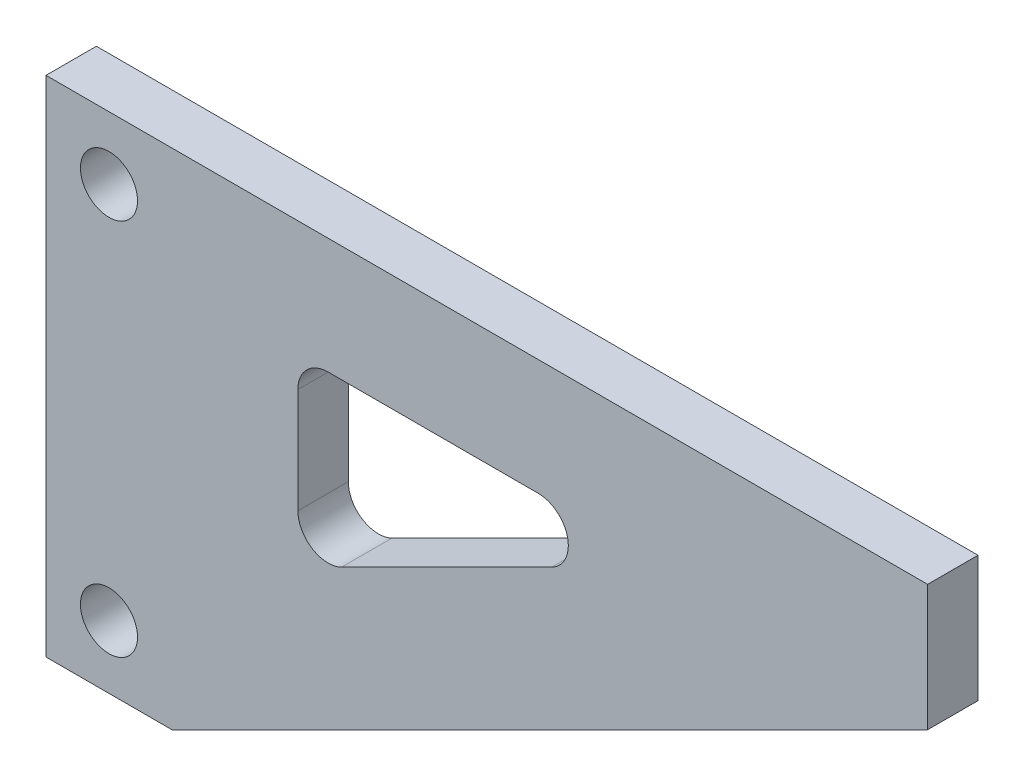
ISO-10303-21;
HEADER;
FILE_DESCRIPTION(('STEP AP214'),'2;1');
FILE_NAME('part.step','',(''),(''),'','','');
FILE_SCHEMA(('AUTOMOTIVE_DESIGN { 1 0 10303 214 1 1 1 1 }'));
ENDSEC;
DATA;
#1=APPLICATION_CONTEXT('core data for automotive mechanical design processes');
#2=APPLICATION_PROTOCOL_DEFINITION('international standard','automotive_design',2000,#1);
#3=PRODUCT_CONTEXT('',#1,'mechanical');
#4=PRODUCT('Part','Part','',(#3));
#5=PRODUCT_RELATED_PRODUCT_CATEGORY('part','',(#4));
#6=PRODUCT_DEFINITION_FORMATION('','',#4);
#7=PRODUCT_DEFINITION_CONTEXT('part definition',#1,'design');
#8=PRODUCT_DEFINITION('design','',#6,#7);
#9=PRODUCT_DEFINITION_SHAPE('','',#8);
#10=(LENGTH_UNIT() NAMED_UNIT(*) SI_UNIT(.MILLI.,.METRE.));
#11=(NAMED_UNIT(*) PLANE_ANGLE_UNIT() SI_UNIT($,.RADIAN.));
#12=(NAMED_UNIT(*) SI_UNIT($,.STERADIAN.) SOLID_ANGLE_UNIT());
#13=UNCERTAINTY_MEASURE_WITH_UNIT(LENGTH_MEASURE(1.E-05),#10,'distance_accuracy_value','');
#14=(GEOMETRIC_REPRESENTATION_CONTEXT(3) GLOBAL_UNCERTAINTY_ASSIGNED_CONTEXT((#13)) GLOBAL_UNIT_ASSIGNED_CONTEXT((#10,
#11,#12)) REPRESENTATION_CONTEXT('',''));
#15=CARTESIAN_POINT('',(0.,0.,0.));
#16=DIRECTION('',(0.,0.,1.));
#17=DIRECTION('',(1.,0.,0.));
#18=AXIS2_PLACEMENT_3D('',#15,#16,#17);
#19=CARTESIAN_POINT('',(0.,0.,5.));
#20=DIRECTION('',(1.,0.,0.));
#21=DIRECTION('',(0.,0.,-1.));
#22=AXIS2_PLACEMENT_3D('',#19,#20,#21);
#23=PLANE('',#22);
#24=DIRECTION('',(0.,-1.,0.));
#25=VECTOR('',#24,1.);
#26=CARTESIAN_POINT('',(0.,0.,-5.));
#27=LINE('',#26,#25);
#28=CARTESIAN_POINT('',(0.,100.,-5.));
#29=VERTEX_POINT('',#28);
#30=CARTESIAN_POINT('',(0.,0.,-5.));
#31=VERTEX_POINT('',#30);
#32=EDGE_CURVE('E193',#29,#31,#27,.T.);
#33=ORIENTED_EDGE('',*,*,#32,.T.);
#34=DIRECTION('',(0.,0.,-1.));
#35=VECTOR('',#34,1.);
#36=CARTESIAN_POINT('',(0.,0.,5.));
#37=LINE('',#36,#35);
#38=CARTESIAN_POINT('',(0.,0.,5.));
#39=VERTEX_POINT('',#38);
#40=EDGE_CURVE('E11',#39,#31,#37,.T.);
#41=ORIENTED_EDGE('',*,*,#40,.F.);
#42=DIRECTION('',(0.,-1.,0.));
#43=VECTOR('',#42,1.);
#44=CARTESIAN_POINT('',(0.,0.,5.));
#45=LINE('',#44,#43);
#46=CARTESIAN_POINT('',(0.,100.,5.));
#47=VERTEX_POINT('',#46);
#48=EDGE_CURVE('E205',#47,#39,#45,.T.);
#49=ORIENTED_EDGE('',*,*,#48,.F.);
#50=DIRECTION('',(0.,0.,-1.));
#51=VECTOR('',#50,1.);
#52=CARTESIAN_POINT('',(0.,100.,5.));
#53=LINE('',#52,#51);
#54=EDGE_CURVE('E222',#47,#29,#53,.T.);
#55=ORIENTED_EDGE('',*,*,#54,.T.);
#56=EDGE_LOOP('',(#33,#41,#49,#55));
#57=FACE_BOUND('',#56,.T.);
#58=ADVANCED_FACE('F47',(#57),#23,.F.);
#59=CARTESIAN_POINT('',(25.,0.,5.));
#60=DIRECTION('',(0.,1.,0.));
#61=DIRECTION('',(-1.,0.,0.));
#62=AXIS2_PLACEMENT_3D('',#59,#60,#61);
#63=PLANE('',#62);
#64=DIRECTION('',(1.,0.,0.));
#65=VECTOR('',#64,1.);
#66=CARTESIAN_POINT('',(25.,0.,-5.));
#67=LINE('',#66,#65);
#68=CARTESIAN_POINT('',(25.,0.,-5.));
#69=VERTEX_POINT('',#68);
#70=EDGE_CURVE('E226',#31,#69,#67,.T.);
#71=ORIENTED_EDGE('',*,*,#70,.T.);
#72=DIRECTION('',(0.,0.,-1.));
#73=VECTOR('',#72,1.);
#74=CARTESIAN_POINT('',(25.,0.,5.));
#75=LINE('',#74,#73);
#76=CARTESIAN_POINT('',(25.,0.,5.));
#77=VERTEX_POINT('',#76);
#78=EDGE_CURVE('E55',#77,#69,#75,.T.);
#79=ORIENTED_EDGE('',*,*,#78,.F.);
#80=DIRECTION('',(1.,0.,0.));
#81=VECTOR('',#80,1.);
#82=CARTESIAN_POINT('',(25.,0.,5.));
#83=LINE('',#82,#81);
#84=EDGE_CURVE('E209',#39,#77,#83,.T.);
#85=ORIENTED_EDGE('',*,*,#84,.F.);
#86=ORIENTED_EDGE('',*,*,#40,.T.);
#87=EDGE_LOOP('',(#71,#79,#85,#86));
#88=FACE_BOUND('',#87,.T.);
#89=ADVANCED_FACE('F271',(#88),#63,.F.);
#90=CARTESIAN_POINT('',(175.,75.,5.));
#91=DIRECTION('',(-0.447213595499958,0.894427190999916,0.));
#92=DIRECTION('',(-0.894427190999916,-0.447213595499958,0.));
#93=AXIS2_PLACEMENT_3D('',#90,#91,#92);
#94=PLANE('',#93);
#95=DIRECTION('',(0.894427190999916,0.447213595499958,0.));
#96=VECTOR('',#95,1.);
#97=CARTESIAN_POINT('',(175.,75.,-5.));
#98=LINE('',#97,#96);
#99=CARTESIAN_POINT('',(175.,75.,-5.));
#100=VERTEX_POINT('',#99);
#101=EDGE_CURVE('E229',#69,#100,#98,.T.);
#102=ORIENTED_EDGE('',*,*,#101,.T.);
#103=DIRECTION('',(0.,0.,-1.));
#104=VECTOR('',#103,1.);
#105=CARTESIAN_POINT('',(175.,75.,5.));
#106=LINE('',#105,#104);
#107=CARTESIAN_POINT('',(175.,75.,5.));
#108=VERTEX_POINT('',#107);
#109=EDGE_CURVE('E244',#108,#100,#106,.T.);
#110=ORIENTED_EDGE('',*,*,#109,.F.);
#111=DIRECTION('',(0.894427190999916,0.447213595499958,0.));
#112=VECTOR('',#111,1.);
#113=CARTESIAN_POINT('',(175.,75.,5.));
#114=LINE('',#113,#112);
#115=EDGE_CURVE('E213',#77,#108,#114,.T.);
#116=ORIENTED_EDGE('',*,*,#115,.F.);
#117=ORIENTED_EDGE('',*,*,#78,.T.);
#118=EDGE_LOOP('',(#102,#110,#116,#117));
#119=FACE_BOUND('',#118,.T.);
#120=ADVANCED_FACE('F253',(#119),#94,.F.);
#121=CARTESIAN_POINT('',(175.,100.,5.));
#122=DIRECTION('',(-1.,0.,0.));
#123=DIRECTION('',(0.,0.,1.));
#124=AXIS2_PLACEMENT_3D('',#121,#122,#123);
#125=PLANE('',#124);
#126=DIRECTION('',(0.,1.,0.));
#127=VECTOR('',#126,1.);
#128=CARTESIAN_POINT('',(175.,100.,-5.));
#129=LINE('',#128,#127);
#130=CARTESIAN_POINT('',(175.,100.,-5.));
#131=VERTEX_POINT('',#130);
#132=EDGE_CURVE('E232',#100,#131,#129,.T.);
#133=ORIENTED_EDGE('',*,*,#132,.T.);
#134=DIRECTION('',(0.,0.,-1.));
#135=VECTOR('',#134,1.);
#136=CARTESIAN_POINT('',(175.,100.,5.));
#137=LINE('',#136,#135);
#138=CARTESIAN_POINT('',(175.,100.,5.));
#139=VERTEX_POINT('',#138);
#140=EDGE_CURVE('E240',#139,#131,#137,.T.);
#141=ORIENTED_EDGE('',*,*,#140,.F.);
#142=DIRECTION('',(0.,1.,0.));
#143=VECTOR('',#142,1.);
#144=CARTESIAN_POINT('',(175.,100.,5.));
#145=LINE('',#144,#143);
#146=EDGE_CURVE('E216',#108,#139,#145,.T.);
#147=ORIENTED_EDGE('',*,*,#146,.F.);
#148=ORIENTED_EDGE('',*,*,#109,.T.);
#149=EDGE_LOOP('',(#133,#141,#147,#148));
#150=FACE_BOUND('',#149,.T.);
#151=ADVANCED_FACE('F261',(#150),#125,.F.);
#152=CARTESIAN_POINT('',(0.,100.,5.));
#153=DIRECTION('',(0.,-1.,0.));
#154=DIRECTION('',(0.,0.,-1.));
#155=AXIS2_PLACEMENT_3D('',#152,#153,#154);
#156=PLANE('',#155);
#157=DIRECTION('',(-1.,0.,0.));
#158=VECTOR('',#157,1.);
#159=CARTESIAN_POINT('',(0.,100.,-5.));
#160=LINE('',#159,#158);
#161=EDGE_CURVE('E210',#131,#29,#160,.T.);
#162=ORIENTED_EDGE('',*,*,#161,.T.);
#163=ORIENTED_EDGE('',*,*,#54,.F.);
#164=DIRECTION('',(-1.,0.,0.));
#165=VECTOR('',#164,1.);
#166=CARTESIAN_POINT('',(0.,100.,5.));
#167=LINE('',#166,#165);
#168=EDGE_CURVE('E219',#139,#47,#167,.T.);
#169=ORIENTED_EDGE('',*,*,#168,.F.);
#170=ORIENTED_EDGE('',*,*,#140,.T.);
#171=EDGE_LOOP('',(#162,#163,#169,#170));
#172=FACE_BOUND('',#171,.T.);
#173=ADVANCED_FACE('F265',(#172),#156,.F.);
#174=CARTESIAN_POINT('',(0.,100.,5.));
#175=DIRECTION('',(0.,0.,-1.));
#176=DIRECTION('',(-1.,0.,0.));
#177=AXIS2_PLACEMENT_3D('',#174,#175,#176);
#178=PLANE('',#177);
#179=CARTESIAN_POINT('',(12.5,87.5,5.));
#180=DIRECTION('',(0.,0.,1.));
#181=DIRECTION('',(1.,0.,0.));
#182=AXIS2_PLACEMENT_3D('',#179,#180,#181);
#183=CIRCLE('',#182,5.66755120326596);
#184=CARTESIAN_POINT('',(18.167551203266,87.5,5.));
#185=VERTEX_POINT('',#184);
#186=EDGE_CURVE('E325',#185,#185,#183,.T.);
#187=ORIENTED_EDGE('',*,*,#186,.F.);
#188=EDGE_LOOP('',(#187));
#189=FACE_BOUND('',#188,.T.);
#190=CARTESIAN_POINT('',(12.5,12.5,5.));
#191=DIRECTION('',(0.,0.,1.));
#192=DIRECTION('',(1.,0.,0.));
#193=AXIS2_PLACEMENT_3D('',#190,#191,#192);
#194=CIRCLE('',#193,5.66755120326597);
#195=CARTESIAN_POINT('',(18.167551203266,12.5,5.));
#196=VERTEX_POINT('',#195);
#197=EDGE_CURVE('E327',#196,#196,#194,.T.);
#198=ORIENTED_EDGE('',*,*,#197,.F.);
#199=EDGE_LOOP('',(#198));
#200=FACE_BOUND('',#199,.T.);
#201=DIRECTION('',(-1.,0.,0.));
#202=VECTOR('',#201,1.);
#203=CARTESIAN_POINT('',(56.,77.,5.));
#204=LINE('',#203,#202);
#205=CARTESIAN_POINT('',(97.6818926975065,77.,5.));
#206=VERTEX_POINT('',#205);
#207=CARTESIAN_POINT('',(56.,77.,5.));
#208=VERTEX_POINT('',#207);
#209=EDGE_CURVE('E175',#206,#208,#204,.T.);
#210=ORIENTED_EDGE('',*,*,#209,.F.);
#211=CARTESIAN_POINT('',(97.6818926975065,71.,5.));
#212=DIRECTION('',(0.,0.,1.));
#213=DIRECTION('',(-1.,0.,0.));
#214=AXIS2_PLACEMENT_3D('',#211,#212,#213);
#215=CIRCLE('',#214,6.);
#216=CARTESIAN_POINT('',(100.365174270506,65.6334368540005,5.));
#217=VERTEX_POINT('',#216);
#218=EDGE_CURVE('E62',#217,#206,#215,.T.);
#219=ORIENTED_EDGE('',*,*,#218,.F.);
#220=DIRECTION('',(0.894427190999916,0.447213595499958,0.));
#221=VECTOR('',#220,1.);
#222=CARTESIAN_POINT('',(58.6832815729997,44.7924905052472,5.));
#223=LINE('',#222,#221);
#224=CARTESIAN_POINT('',(58.6832815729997,44.7924905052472,5.));
#225=VERTEX_POINT('',#224);
#226=EDGE_CURVE('E152',#225,#217,#223,.T.);
#227=ORIENTED_EDGE('',*,*,#226,.F.);
#228=CARTESIAN_POINT('',(56.,50.1590536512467,5.));
#229=DIRECTION('',(0.,0.,1.));
#230=DIRECTION('',(1.,0.,0.));
#231=AXIS2_PLACEMENT_3D('',#228,#229,#230);
#232=CIRCLE('',#231,6.);
#233=CARTESIAN_POINT('',(50.,50.1590536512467,5.));
#234=VERTEX_POINT('',#233);
#235=EDGE_CURVE('E156',#234,#225,#232,.T.);
#236=ORIENTED_EDGE('',*,*,#235,.F.);
#237=DIRECTION('',(0.,-1.,0.));
#238=VECTOR('',#237,1.);
#239=CARTESIAN_POINT('',(50.,71.,5.));
#240=LINE('',#239,#238);
#241=CARTESIAN_POINT('',(50.,71.,5.));
#242=VERTEX_POINT('',#241);
#243=EDGE_CURVE('E183',#242,#234,#240,.T.);
#244=ORIENTED_EDGE('',*,*,#243,.F.);
#245=CARTESIAN_POINT('',(56.,71.,5.));
#246=DIRECTION('',(0.,0.,1.));
#247=DIRECTION('',(1.,0.,0.));
#248=AXIS2_PLACEMENT_3D('',#245,#246,#247);
#249=CIRCLE('',#248,6.);
#250=EDGE_CURVE('E179',#208,#242,#249,.T.);
#251=ORIENTED_EDGE('',*,*,#250,.F.);
#252=EDGE_LOOP('',(#210,#219,#227,#236,#244,#251));
#253=FACE_BOUND('',#252,.T.);
#254=ORIENTED_EDGE('',*,*,#48,.T.);
#255=ORIENTED_EDGE('',*,*,#84,.T.);
#256=ORIENTED_EDGE('',*,*,#115,.T.);
#257=ORIENTED_EDGE('',*,*,#146,.T.);
#258=ORIENTED_EDGE('',*,*,#168,.T.);
#259=EDGE_LOOP('',(#254,#255,#256,#257,#258));
#260=FACE_BOUND('',#259,.T.);
#261=ADVANCED_FACE('F269',(#189,#200,#253,#260),#178,.F.);
#262=CARTESIAN_POINT('',(0.,100.,-5.));
#263=DIRECTION('',(0.,0.,-1.));
#264=DIRECTION('',(-1.,0.,0.));
#265=AXIS2_PLACEMENT_3D('',#262,#263,#264);
#266=PLANE('',#265);
#267=CARTESIAN_POINT('',(12.5,87.5,-5.));
#268=DIRECTION('',(0.,0.,1.));
#269=DIRECTION('',(1.,0.,0.));
#270=AXIS2_PLACEMENT_3D('',#267,#268,#269);
#271=CIRCLE('',#270,5.66755120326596);
#272=CARTESIAN_POINT('',(18.167551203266,87.5,-5.));
#273=VERTEX_POINT('',#272);
#274=EDGE_CURVE('E176',#273,#273,#271,.T.);
#275=ORIENTED_EDGE('',*,*,#274,.T.);
#276=EDGE_LOOP('',(#275));
#277=FACE_BOUND('',#276,.T.);
#278=CARTESIAN_POINT('',(12.5,12.5,-5.));
#279=DIRECTION('',(0.,0.,1.));
#280=DIRECTION('',(1.,0.,0.));
#281=AXIS2_PLACEMENT_3D('',#278,#279,#280);
#282=CIRCLE('',#281,5.66755120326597);
#283=CARTESIAN_POINT('',(18.167551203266,12.5,-5.));
#284=VERTEX_POINT('',#283);
#285=EDGE_CURVE('E159',#284,#284,#282,.T.);
#286=ORIENTED_EDGE('',*,*,#285,.T.);
#287=EDGE_LOOP('',(#286));
#288=FACE_BOUND('',#287,.T.);
#289=CARTESIAN_POINT('',(97.6818926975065,71.,-5.));
#290=DIRECTION('',(0.,0.,1.));
#291=DIRECTION('',(-1.,0.,0.));
#292=AXIS2_PLACEMENT_3D('',#289,#290,#291);
#293=CIRCLE('',#292,6.);
#294=CARTESIAN_POINT('',(100.365174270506,65.6334368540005,-5.));
#295=VERTEX_POINT('',#294);
#296=CARTESIAN_POINT('',(97.6818926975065,77.,-5.));
#297=VERTEX_POINT('',#296);
#298=EDGE_CURVE('E132',#295,#297,#293,.T.);
#299=ORIENTED_EDGE('',*,*,#298,.T.);
#300=DIRECTION('',(-1.,0.,0.));
#301=VECTOR('',#300,1.);
#302=CARTESIAN_POINT('',(56.,77.,-5.));
#303=LINE('',#302,#301);
#304=CARTESIAN_POINT('',(56.,77.,-5.));
#305=VERTEX_POINT('',#304);
#306=EDGE_CURVE('E142',#297,#305,#303,.T.);
#307=ORIENTED_EDGE('',*,*,#306,.T.);
#308=CARTESIAN_POINT('',(56.,71.,-5.));
#309=DIRECTION('',(0.,0.,1.));
#310=DIRECTION('',(1.,0.,0.));
#311=AXIS2_PLACEMENT_3D('',#308,#309,#310);
#312=CIRCLE('',#311,6.);
#313=CARTESIAN_POINT('',(50.,71.,-5.));
#314=VERTEX_POINT('',#313);
#315=EDGE_CURVE('E70',#305,#314,#312,.T.);
#316=ORIENTED_EDGE('',*,*,#315,.T.);
#317=DIRECTION('',(0.,-1.,0.));
#318=VECTOR('',#317,1.);
#319=CARTESIAN_POINT('',(50.,71.,-5.));
#320=LINE('',#319,#318);
#321=CARTESIAN_POINT('',(50.,50.1590536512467,-5.));
#322=VERTEX_POINT('',#321);
#323=EDGE_CURVE('E164',#314,#322,#320,.T.);
#324=ORIENTED_EDGE('',*,*,#323,.T.);
#325=CARTESIAN_POINT('',(56.,50.1590536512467,-5.));
#326=DIRECTION('',(0.,0.,1.));
#327=DIRECTION('',(1.,0.,0.));
#328=AXIS2_PLACEMENT_3D('',#325,#326,#327);
#329=CIRCLE('',#328,6.);
#330=CARTESIAN_POINT('',(58.6832815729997,44.7924905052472,-5.));
#331=VERTEX_POINT('',#330);
#332=EDGE_CURVE('E168',#322,#331,#329,.T.);
#333=ORIENTED_EDGE('',*,*,#332,.T.);
#334=DIRECTION('',(0.894427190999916,0.447213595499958,0.));
#335=VECTOR('',#334,1.);
#336=CARTESIAN_POINT('',(58.6832815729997,44.7924905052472,-5.));
#337=LINE('',#336,#335);
#338=EDGE_CURVE('E139',#331,#295,#337,.T.);
#339=ORIENTED_EDGE('',*,*,#338,.T.);
#340=EDGE_LOOP('',(#299,#307,#316,#324,#333,#339));
#341=FACE_BOUND('',#340,.T.);
#342=ORIENTED_EDGE('',*,*,#32,.F.);
#343=ORIENTED_EDGE('',*,*,#161,.F.);
#344=ORIENTED_EDGE('',*,*,#132,.F.);
#345=ORIENTED_EDGE('',*,*,#101,.F.);
#346=ORIENTED_EDGE('',*,*,#70,.F.);
#347=EDGE_LOOP('',(#342,#343,#344,#345,#346));
#348=FACE_BOUND('',#347,.T.);
#349=ADVANCED_FACE('F147',(#277,#288,#341,#348),#266,.T.);
#350=CARTESIAN_POINT('',(97.6818926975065,71.,-5.));
#351=DIRECTION('',(0.,0.,1.));
#352=DIRECTION('',(1.,0.,0.));
#353=AXIS2_PLACEMENT_3D('',#350,#351,#352);
#354=CYLINDRICAL_SURFACE('',#353,6.);
#355=ORIENTED_EDGE('',*,*,#218,.T.);
#356=DIRECTION('',(0.,0.,1.));
#357=VECTOR('',#356,1.);
#358=CARTESIAN_POINT('',(97.6818926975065,77.,-5.));
#359=LINE('',#358,#357);
#360=EDGE_CURVE('E128',#297,#206,#359,.T.);
#361=ORIENTED_EDGE('',*,*,#360,.F.);
#362=ORIENTED_EDGE('',*,*,#298,.F.);
#363=DIRECTION('',(0.,0.,1.));
#364=VECTOR('',#363,1.);
#365=CARTESIAN_POINT('',(100.365174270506,65.6334368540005,-5.));
#366=LINE('',#365,#364);
#367=EDGE_CURVE('E190',#295,#217,#366,.T.);
#368=ORIENTED_EDGE('',*,*,#367,.T.);
#369=EDGE_LOOP('',(#355,#361,#362,#368));
#370=FACE_BOUND('',#369,.T.);
#371=ADVANCED_FACE('F130',(#370),#354,.F.);
#372=CARTESIAN_POINT('',(58.6832815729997,44.7924905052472,-5.));
#373=DIRECTION('',(0.447213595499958,-0.894427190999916,0.));
#374=DIRECTION('',(0.894427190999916,0.447213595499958,0.));
#375=AXIS2_PLACEMENT_3D('',#372,#373,#374);
#376=PLANE('',#375);
#377=ORIENTED_EDGE('',*,*,#226,.T.);
#378=ORIENTED_EDGE('',*,*,#367,.F.);
#379=ORIENTED_EDGE('',*,*,#338,.F.);
#380=DIRECTION('',(0.,0.,1.));
#381=VECTOR('',#380,1.);
#382=CARTESIAN_POINT('',(58.6832815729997,44.7924905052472,-5.));
#383=LINE('',#382,#381);
#384=EDGE_CURVE('E194',#331,#225,#383,.T.);
#385=ORIENTED_EDGE('',*,*,#384,.T.);
#386=EDGE_LOOP('',(#377,#378,#379,#385));
#387=FACE_BOUND('',#386,.T.);
#388=ADVANCED_FACE('F294',(#387),#376,.F.);
#389=CARTESIAN_POINT('',(56.,50.1590536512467,-5.));
#390=DIRECTION('',(0.,0.,1.));
#391=DIRECTION('',(1.,0.,0.));
#392=AXIS2_PLACEMENT_3D('',#389,#390,#391);
#393=CYLINDRICAL_SURFACE('',#392,6.);
#394=ORIENTED_EDGE('',*,*,#235,.T.);
#395=ORIENTED_EDGE('',*,*,#384,.F.);
#396=ORIENTED_EDGE('',*,*,#332,.F.);
#397=DIRECTION('',(0.,0.,1.));
#398=VECTOR('',#397,1.);
#399=CARTESIAN_POINT('',(50.,50.1590536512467,-5.));
#400=LINE('',#399,#398);
#401=EDGE_CURVE('E197',#322,#234,#400,.T.);
#402=ORIENTED_EDGE('',*,*,#401,.T.);
#403=EDGE_LOOP('',(#394,#395,#396,#402));
#404=FACE_BOUND('',#403,.T.);
#405=ADVANCED_FACE('F304',(#404),#393,.F.);
#406=CARTESIAN_POINT('',(50.,71.,-5.));
#407=DIRECTION('',(-1.,0.,0.));
#408=DIRECTION('',(0.,0.,1.));
#409=AXIS2_PLACEMENT_3D('',#406,#407,#408);
#410=PLANE('',#409);
#411=ORIENTED_EDGE('',*,*,#243,.T.);
#412=ORIENTED_EDGE('',*,*,#401,.F.);
#413=ORIENTED_EDGE('',*,*,#323,.F.);
#414=DIRECTION('',(0.,0.,1.));
#415=VECTOR('',#414,1.);
#416=CARTESIAN_POINT('',(50.,71.,-5.));
#417=LINE('',#416,#415);
#418=EDGE_CURVE('E200',#314,#242,#417,.T.);
#419=ORIENTED_EDGE('',*,*,#418,.T.);
#420=EDGE_LOOP('',(#411,#412,#413,#419));
#421=FACE_BOUND('',#420,.T.);
#422=ADVANCED_FACE('F301',(#421),#410,.F.);
#423=CARTESIAN_POINT('',(56.,71.,-5.));
#424=DIRECTION('',(0.,0.,1.));
#425=DIRECTION('',(1.,0.,0.));
#426=AXIS2_PLACEMENT_3D('',#423,#424,#425);
#427=CYLINDRICAL_SURFACE('',#426,6.);
#428=ORIENTED_EDGE('',*,*,#250,.T.);
#429=ORIENTED_EDGE('',*,*,#418,.F.);
#430=ORIENTED_EDGE('',*,*,#315,.F.);
#431=DIRECTION('',(0.,0.,1.));
#432=VECTOR('',#431,1.);
#433=CARTESIAN_POINT('',(56.,77.,-5.));
#434=LINE('',#433,#432);
#435=EDGE_CURVE('E138',#305,#208,#434,.T.);
#436=ORIENTED_EDGE('',*,*,#435,.T.);
#437=EDGE_LOOP('',(#428,#429,#430,#436));
#438=FACE_BOUND('',#437,.T.);
#439=ADVANCED_FACE('F298',(#438),#427,.F.);
#440=CARTESIAN_POINT('',(56.,77.,-5.));
#441=DIRECTION('',(0.,1.,0.));
#442=DIRECTION('',(0.,0.,1.));
#443=AXIS2_PLACEMENT_3D('',#440,#441,#442);
#444=PLANE('',#443);
#445=ORIENTED_EDGE('',*,*,#209,.T.);
#446=ORIENTED_EDGE('',*,*,#435,.F.);
#447=ORIENTED_EDGE('',*,*,#306,.F.);
#448=ORIENTED_EDGE('',*,*,#360,.T.);
#449=EDGE_LOOP('',(#445,#446,#447,#448));
#450=FACE_BOUND('',#449,.T.);
#451=ADVANCED_FACE('F143',(#450),#444,.F.);
#452=CARTESIAN_POINT('',(12.5,12.5,-5.));
#453=DIRECTION('',(0.,0.,1.));
#454=DIRECTION('',(1.,0.,0.));
#455=AXIS2_PLACEMENT_3D('',#452,#453,#454);
#456=CYLINDRICAL_SURFACE('',#455,5.66755120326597);
#457=ORIENTED_EDGE('',*,*,#285,.F.);
#458=EDGE_LOOP('',(#457));
#459=FACE_BOUND('',#458,.T.);
#460=ORIENTED_EDGE('',*,*,#197,.T.);
#461=EDGE_LOOP('',(#460));
#462=FACE_BOUND('',#461,.T.);
#463=ADVANCED_FACE('F297',(#459,#462),#456,.F.);
#464=CARTESIAN_POINT('',(12.5,87.5,-5.));
#465=DIRECTION('',(0.,0.,1.));
#466=DIRECTION('',(1.,0.,0.));
#467=AXIS2_PLACEMENT_3D('',#464,#465,#466);
#468=CYLINDRICAL_SURFACE('',#467,5.66755120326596);
#469=ORIENTED_EDGE('',*,*,#274,.F.);
#470=EDGE_LOOP('',(#469));
#471=FACE_BOUND('',#470,.T.);
#472=ORIENTED_EDGE('',*,*,#186,.T.);
#473=EDGE_LOOP('',(#472));
#474=FACE_BOUND('',#473,.T.);
#475=ADVANCED_FACE('F314',(#471,#474),#468,.F.);
#476=CLOSED_SHELL('',(#58,#89,#120,#151,#173,#261,#349,#371,#388,#405,#422,#439,#451,#463,#475));
#477=MANIFOLD_SOLID_BREP('B2',#476);
#478=ADVANCED_BREP_SHAPE_REPRESENTATION('',(#18,#477),#14);
#479=SHAPE_DEFINITION_REPRESENTATION(#9,#478);
ENDSEC;
END-ISO-10303-21;
